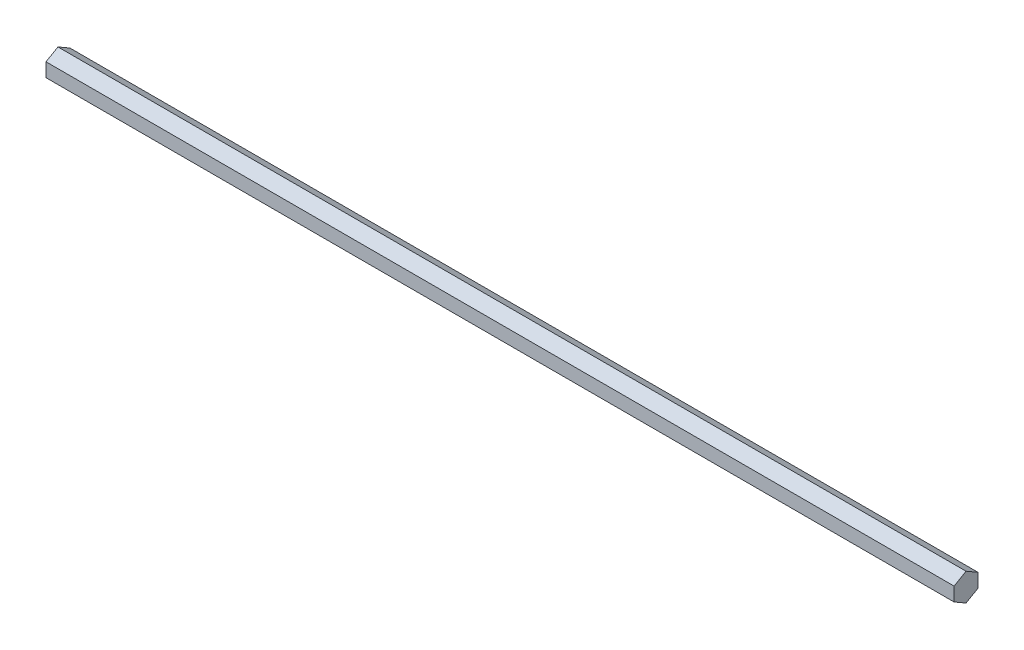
ISO-10303-21;
HEADER;
FILE_DESCRIPTION(('STEP AP214'),'2;1');
FILE_NAME('part.step','',(''),(''),'','','');
FILE_SCHEMA(('AUTOMOTIVE_DESIGN { 1 0 10303 214 1 1 1 1 }'));
ENDSEC;
DATA;
#1=APPLICATION_CONTEXT('core data for automotive mechanical design processes');
#2=APPLICATION_PROTOCOL_DEFINITION('international standard','automotive_design',2000,#1);
#3=PRODUCT_CONTEXT('',#1,'mechanical');
#4=PRODUCT('Part','Part','',(#3));
#5=PRODUCT_RELATED_PRODUCT_CATEGORY('part','',(#4));
#6=PRODUCT_DEFINITION_FORMATION('','',#4);
#7=PRODUCT_DEFINITION_CONTEXT('part definition',#1,'design');
#8=PRODUCT_DEFINITION('design','',#6,#7);
#9=PRODUCT_DEFINITION_SHAPE('','',#8);
#10=(LENGTH_UNIT() NAMED_UNIT(*) SI_UNIT(.MILLI.,.METRE.));
#11=(NAMED_UNIT(*) PLANE_ANGLE_UNIT() SI_UNIT($,.RADIAN.));
#12=(NAMED_UNIT(*) SI_UNIT($,.STERADIAN.) SOLID_ANGLE_UNIT());
#13=UNCERTAINTY_MEASURE_WITH_UNIT(LENGTH_MEASURE(1.E-05),#10,'distance_accuracy_value','');
#14=(GEOMETRIC_REPRESENTATION_CONTEXT(3) GLOBAL_UNCERTAINTY_ASSIGNED_CONTEXT((#13)) GLOBAL_UNIT_ASSIGNED_CONTEXT((#10,
#11,#12)) REPRESENTATION_CONTEXT('',''));
#15=CARTESIAN_POINT('',(0.,0.,0.));
#16=DIRECTION('',(0.,0.,1.));
#17=DIRECTION('',(1.,0.,0.));
#18=AXIS2_PLACEMENT_3D('',#15,#16,#17);
#19=CARTESIAN_POINT('',(100.,0.759215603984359,-1.315));
#20=DIRECTION('',(0.,-0.866025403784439,0.5));
#21=DIRECTION('',(0.,-0.5,-0.866025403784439));
#22=AXIS2_PLACEMENT_3D('',#19,#20,#21);
#23=PLANE('',#22);
#24=DIRECTION('',(0.,0.5,0.866025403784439));
#25=VECTOR('',#24,1.);
#26=CARTESIAN_POINT('',(0.,0.759215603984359,-1.315));
#27=LINE('',#26,#25);
#28=CARTESIAN_POINT('',(0.,0.759215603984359,-1.315));
#29=VERTEX_POINT('',#28);
#30=CARTESIAN_POINT('',(0.,1.51843120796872,0.));
#31=VERTEX_POINT('',#30);
#32=EDGE_CURVE('E116',#29,#31,#27,.T.);
#33=ORIENTED_EDGE('',*,*,#32,.T.);
#34=DIRECTION('',(-1.,0.,0.));
#35=VECTOR('',#34,1.);
#36=CARTESIAN_POINT('',(100.,1.51843120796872,0.));
#37=LINE('',#36,#35);
#38=CARTESIAN_POINT('',(100.,1.51843120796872,0.));
#39=VERTEX_POINT('',#38);
#40=EDGE_CURVE('E11',#39,#31,#37,.T.);
#41=ORIENTED_EDGE('',*,*,#40,.F.);
#42=DIRECTION('',(0.,0.5,0.866025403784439));
#43=VECTOR('',#42,1.);
#44=CARTESIAN_POINT('',(100.,0.759215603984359,-1.315));
#45=LINE('',#44,#43);
#46=CARTESIAN_POINT('',(100.,0.759215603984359,-1.315));
#47=VERTEX_POINT('',#46);
#48=EDGE_CURVE('E126',#47,#39,#45,.T.);
#49=ORIENTED_EDGE('',*,*,#48,.F.);
#50=DIRECTION('',(-1.,0.,0.));
#51=VECTOR('',#50,1.);
#52=CARTESIAN_POINT('',(100.,0.759215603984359,-1.315));
#53=LINE('',#52,#51);
#54=EDGE_CURVE('E112',#47,#29,#53,.T.);
#55=ORIENTED_EDGE('',*,*,#54,.T.);
#56=EDGE_LOOP('',(#33,#41,#49,#55));
#57=FACE_BOUND('',#56,.T.);
#58=ADVANCED_FACE('F32',(#57),#23,.F.);
#59=CARTESIAN_POINT('',(100.,1.51843120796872,0.));
#60=DIRECTION('',(0.,-0.866025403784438,-0.500000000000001));
#61=DIRECTION('',(0.,0.500000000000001,-0.866025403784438));
#62=AXIS2_PLACEMENT_3D('',#59,#60,#61);
#63=PLANE('',#62);
#64=DIRECTION('',(0.,-0.500000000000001,0.866025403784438));
#65=VECTOR('',#64,1.);
#66=CARTESIAN_POINT('',(0.,1.51843120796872,0.));
#67=LINE('',#66,#65);
#68=CARTESIAN_POINT('',(0.,0.75921560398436,1.315));
#69=VERTEX_POINT('',#68);
#70=EDGE_CURVE('E119',#31,#69,#67,.T.);
#71=ORIENTED_EDGE('',*,*,#70,.T.);
#72=DIRECTION('',(-1.,0.,0.));
#73=VECTOR('',#72,1.);
#74=CARTESIAN_POINT('',(100.,0.75921560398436,1.315));
#75=LINE('',#74,#73);
#76=CARTESIAN_POINT('',(100.,0.75921560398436,1.315));
#77=VERTEX_POINT('',#76);
#78=EDGE_CURVE('E40',#77,#69,#75,.T.);
#79=ORIENTED_EDGE('',*,*,#78,.F.);
#80=DIRECTION('',(0.,-0.500000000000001,0.866025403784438));
#81=VECTOR('',#80,1.);
#82=CARTESIAN_POINT('',(100.,1.51843120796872,0.));
#83=LINE('',#82,#81);
#84=EDGE_CURVE('E85',#39,#77,#83,.T.);
#85=ORIENTED_EDGE('',*,*,#84,.F.);
#86=ORIENTED_EDGE('',*,*,#40,.T.);
#87=EDGE_LOOP('',(#71,#79,#85,#86));
#88=FACE_BOUND('',#87,.T.);
#89=ADVANCED_FACE('F150',(#88),#63,.F.);
#90=CARTESIAN_POINT('',(100.,0.75921560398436,1.315));
#91=DIRECTION('',(0.,0.,-1.));
#92=DIRECTION('',(0.,1.,0.));
#93=AXIS2_PLACEMENT_3D('',#90,#91,#92);
#94=PLANE('',#93);
#95=DIRECTION('',(0.,-1.,0.));
#96=VECTOR('',#95,1.);
#97=CARTESIAN_POINT('',(0.,0.75921560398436,1.315));
#98=LINE('',#97,#96);
#99=CARTESIAN_POINT('',(0.,-0.759215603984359,1.315));
#100=VERTEX_POINT('',#99);
#101=EDGE_CURVE('E121',#69,#100,#98,.T.);
#102=ORIENTED_EDGE('',*,*,#101,.T.);
#103=DIRECTION('',(-1.,0.,0.));
#104=VECTOR('',#103,1.);
#105=CARTESIAN_POINT('',(100.,-0.759215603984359,1.315));
#106=LINE('',#105,#104);
#107=CARTESIAN_POINT('',(100.,-0.759215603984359,1.315));
#108=VERTEX_POINT('',#107);
#109=EDGE_CURVE('E107',#108,#100,#106,.T.);
#110=ORIENTED_EDGE('',*,*,#109,.F.);
#111=DIRECTION('',(0.,-1.,0.));
#112=VECTOR('',#111,1.);
#113=CARTESIAN_POINT('',(100.,0.75921560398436,1.315));
#114=LINE('',#113,#112);
#115=EDGE_CURVE('E98',#77,#108,#114,.T.);
#116=ORIENTED_EDGE('',*,*,#115,.F.);
#117=ORIENTED_EDGE('',*,*,#78,.T.);
#118=EDGE_LOOP('',(#102,#110,#116,#117));
#119=FACE_BOUND('',#118,.T.);
#120=ADVANCED_FACE('F132',(#119),#94,.F.);
#121=CARTESIAN_POINT('',(100.,-0.759215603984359,1.315));
#122=DIRECTION('',(0.,0.866025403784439,-0.499999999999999));
#123=DIRECTION('',(0.,0.499999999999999,0.866025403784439));
#124=AXIS2_PLACEMENT_3D('',#121,#122,#123);
#125=PLANE('',#124);
#126=DIRECTION('',(0.,-0.499999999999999,-0.866025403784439));
#127=VECTOR('',#126,1.);
#128=CARTESIAN_POINT('',(0.,-0.759215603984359,1.315));
#129=LINE('',#128,#127);
#130=CARTESIAN_POINT('',(0.,-1.51843120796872,0.));
#131=VERTEX_POINT('',#130);
#132=EDGE_CURVE('E106',#100,#131,#129,.T.);
#133=ORIENTED_EDGE('',*,*,#132,.T.);
#134=DIRECTION('',(-1.,0.,0.));
#135=VECTOR('',#134,1.);
#136=CARTESIAN_POINT('',(100.,-1.51843120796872,0.));
#137=LINE('',#136,#135);
#138=CARTESIAN_POINT('',(100.,-1.51843120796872,0.));
#139=VERTEX_POINT('',#138);
#140=EDGE_CURVE('E103',#139,#131,#137,.T.);
#141=ORIENTED_EDGE('',*,*,#140,.F.);
#142=DIRECTION('',(0.,-0.499999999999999,-0.866025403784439));
#143=VECTOR('',#142,1.);
#144=CARTESIAN_POINT('',(100.,-0.759215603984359,1.315));
#145=LINE('',#144,#143);
#146=EDGE_CURVE('E92',#108,#139,#145,.T.);
#147=ORIENTED_EDGE('',*,*,#146,.F.);
#148=ORIENTED_EDGE('',*,*,#109,.T.);
#149=EDGE_LOOP('',(#133,#141,#147,#148));
#150=FACE_BOUND('',#149,.T.);
#151=ADVANCED_FACE('F104',(#150),#125,.F.);
#152=CARTESIAN_POINT('',(100.,-1.51843120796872,0.));
#153=DIRECTION('',(0.,0.866025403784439,0.5));
#154=DIRECTION('',(0.,-0.5,0.866025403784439));
#155=AXIS2_PLACEMENT_3D('',#152,#153,#154);
#156=PLANE('',#155);
#157=DIRECTION('',(0.,0.5,-0.866025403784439));
#158=VECTOR('',#157,1.);
#159=CARTESIAN_POINT('',(0.,-1.51843120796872,0.));
#160=LINE('',#159,#158);
#161=CARTESIAN_POINT('',(0.,-0.759215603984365,-1.315));
#162=VERTEX_POINT('',#161);
#163=EDGE_CURVE('E71',#131,#162,#160,.T.);
#164=ORIENTED_EDGE('',*,*,#163,.T.);
#165=DIRECTION('',(-1.,0.,0.));
#166=VECTOR('',#165,1.);
#167=CARTESIAN_POINT('',(100.,-0.759215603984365,-1.315));
#168=LINE('',#167,#166);
#169=CARTESIAN_POINT('',(100.,-0.759215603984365,-1.315));
#170=VERTEX_POINT('',#169);
#171=EDGE_CURVE('E108',#170,#162,#168,.T.);
#172=ORIENTED_EDGE('',*,*,#171,.F.);
#173=DIRECTION('',(0.,0.5,-0.866025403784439));
#174=VECTOR('',#173,1.);
#175=CARTESIAN_POINT('',(100.,-1.51843120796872,0.));
#176=LINE('',#175,#174);
#177=EDGE_CURVE('E96',#139,#170,#176,.T.);
#178=ORIENTED_EDGE('',*,*,#177,.F.);
#179=ORIENTED_EDGE('',*,*,#140,.T.);
#180=EDGE_LOOP('',(#164,#172,#178,#179));
#181=FACE_BOUND('',#180,.T.);
#182=ADVANCED_FACE('F110',(#181),#156,.F.);
#183=CARTESIAN_POINT('',(100.,-0.759215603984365,-1.315));
#184=DIRECTION('',(0.,0.,1.));
#185=DIRECTION('',(1.,0.,0.));
#186=AXIS2_PLACEMENT_3D('',#183,#184,#185);
#187=PLANE('',#186);
#188=DIRECTION('',(0.,1.,0.));
#189=VECTOR('',#188,1.);
#190=CARTESIAN_POINT('',(0.,-0.759215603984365,-1.315));
#191=LINE('',#190,#189);
#192=EDGE_CURVE('E77',#162,#29,#191,.T.);
#193=ORIENTED_EDGE('',*,*,#192,.T.);
#194=ORIENTED_EDGE('',*,*,#54,.F.);
#195=DIRECTION('',(0.,1.,0.));
#196=VECTOR('',#195,1.);
#197=CARTESIAN_POINT('',(100.,-0.759215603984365,-1.315));
#198=LINE('',#197,#196);
#199=EDGE_CURVE('E48',#170,#47,#198,.T.);
#200=ORIENTED_EDGE('',*,*,#199,.F.);
#201=ORIENTED_EDGE('',*,*,#171,.T.);
#202=EDGE_LOOP('',(#193,#194,#200,#201));
#203=FACE_BOUND('',#202,.T.);
#204=ADVANCED_FACE('F139',(#203),#187,.F.);
#205=CARTESIAN_POINT('',(100.,0.,0.));
#206=DIRECTION('',(1.,0.,0.));
#207=DIRECTION('',(0.,0.,-1.));
#208=AXIS2_PLACEMENT_3D('',#205,#206,#207);
#209=PLANE('',#208);
#210=ORIENTED_EDGE('',*,*,#48,.T.);
#211=ORIENTED_EDGE('',*,*,#84,.T.);
#212=ORIENTED_EDGE('',*,*,#115,.T.);
#213=ORIENTED_EDGE('',*,*,#146,.T.);
#214=ORIENTED_EDGE('',*,*,#177,.T.);
#215=ORIENTED_EDGE('',*,*,#199,.T.);
#216=EDGE_LOOP('',(#210,#211,#212,#213,#214,#215));
#217=FACE_BOUND('',#216,.T.);
#218=ADVANCED_FACE('F94',(#217),#209,.T.);
#219=CARTESIAN_POINT('',(0.,0.,0.));
#220=DIRECTION('',(1.,0.,0.));
#221=DIRECTION('',(0.,0.,-1.));
#222=AXIS2_PLACEMENT_3D('',#219,#220,#221);
#223=PLANE('',#222);
#224=ORIENTED_EDGE('',*,*,#32,.F.);
#225=ORIENTED_EDGE('',*,*,#192,.F.);
#226=ORIENTED_EDGE('',*,*,#163,.F.);
#227=ORIENTED_EDGE('',*,*,#132,.F.);
#228=ORIENTED_EDGE('',*,*,#101,.F.);
#229=ORIENTED_EDGE('',*,*,#70,.F.);
#230=EDGE_LOOP('',(#224,#225,#226,#227,#228,#229));
#231=FACE_BOUND('',#230,.T.);
#232=ADVANCED_FACE('F135',(#231),#223,.F.);
#233=CLOSED_SHELL('',(#58,#89,#120,#151,#182,#204,#218,#232));
#234=MANIFOLD_SOLID_BREP('B2',#233);
#235=ADVANCED_BREP_SHAPE_REPRESENTATION('',(#18,#234),#14);
#236=SHAPE_DEFINITION_REPRESENTATION(#9,#235);
ENDSEC;
END-ISO-10303-21;
